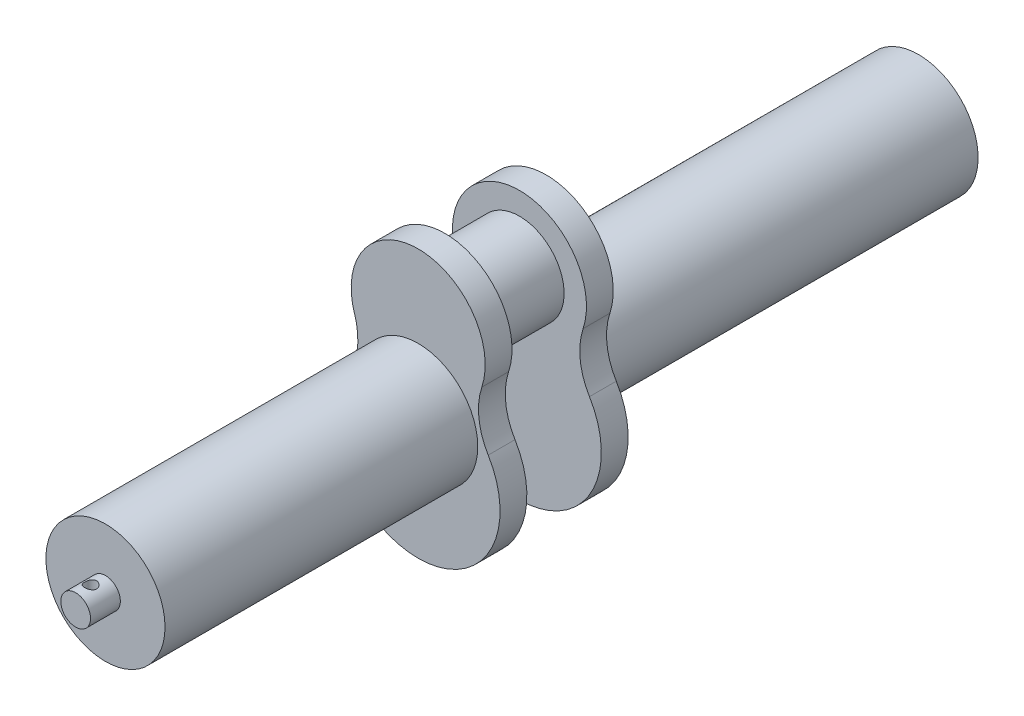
from build123d import *

# Parameters (mm, degrees)
SZKIC1_R                                    = 30
DODANIE_WYCI_GNI_CIE1_DEPTH                 = 25
DODANIE_WYCI_GNI_CIE2_DEPTH                 = 18
SZKIC3_R                                    = 40
DODANIE_WYCI_GNI_CIE3_DEPTH                 = 210
DODANIE_WYCI_GNI_CIE4_START                 = 250
SZKIC4_R                                    = 40
DODANIE_WYCI_GNI_CIE4_DEPTH                 = 250
SZKIC5_R                                    = 10
DODANIE_WYCI_GNI_CIE5_DEPTH                 = 20
WYTNIJ_WYCI_GNI_CIE1_REACH                  = 314.888
WYTNIJ_WYCI_GNI_CIE1_END_RADIUS             = 10
SZKIC6_R                                    = 4
WYTNIJ_WYCI_GNI_CIE1_DIRECTION_2_REACH      = 314.888
WYTNIJ_WYCI_GNI_CIE1_DIRECTION_2_END_RADIUS = 10


with BuildPart() as part:
    # Szkic1 → Dodanie-wyci_gni_cie1 (new, symmetric)
    with BuildSketch(Plane.XY):
        with Locations((0, 50)):
            Circle(SZKIC1_R)
    extrude(amount=DODANIE_WYCI_GNI_CIE1_DEPTH, both=True)

    # Szkic2 → Dodanie-wyci_gni_cie2 (add)
    with BuildSketch(Plane.XY.offset(25)):
        with BuildLine():
            ThreePointArc((42.746299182, 35.9375), (0, 95), (-42.746299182, 35.9375))
            ThreePointArc((-42.746299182, 35.9375), (-40.783578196, 16.765840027), (-47.0209291, -1.46875))
            ThreePointArc((-47.0209291, -1.46875), (0, -85), (47.0209291, -1.46875))
            ThreePointArc((47.0209291, -1.46875), (40.783578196, 16.765840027), (42.746299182, 35.9375))
        make_face()
    dodanie_wyci_gni_cie2 = extrude(amount=DODANIE_WYCI_GNI_CIE2_DEPTH)

    # Szkic3 → Dodanie-wyci_gni_cie3 (add)
    with BuildSketch(Plane.XY.offset(43)):
        Circle(SZKIC3_R)
    extrude(amount=DODANIE_WYCI_GNI_CIE3_DEPTH)

    # Lustro2: Dodanie-wyci_gni_cie2 across plane
    add(dodanie_wyci_gni_cie2.mirror(Plane.XY))

    # Szkic4 → Dodanie-wyci_gni_cie4 (add)
    with BuildSketch(Plane(origin=(0, 0, -43), x_dir=(-1, 0, 0), z_dir=(0, 0, -1)).offset(DODANIE_WYCI_GNI_CIE4_START)):
        with Locations(Location((0, 0, 0), (0, 0, 180))):
            Circle(SZKIC4_R)
    extrude(amount=-DODANIE_WYCI_GNI_CIE4_DEPTH)

    # Szkic5 → Dodanie-wyci_gni_cie5 (add)
    with BuildSketch(Plane.XY.offset(253)):
        Circle(SZKIC5_R)
    extrude(amount=DODANIE_WYCI_GNI_CIE5_DEPTH)

    # Wytnij-wyci_gni_cie1: up to this cylinder (the profile starts inside it)
    wytnij_wyci_gni_cie1_end = Plane(origin=(0, 0, 263), z_dir=(0, 0, -1)) * Cylinder(WYTNIJ_WYCI_GNI_CIE1_END_RADIUS, 650.776, mode=Mode.PRIVATE)
    # Szkic6 → Wytnij-wyci_gni_cie1 (cut, up to the surface)
    with BuildSketch(Plane(origin=(0, 0, 0), x_dir=(1, 0, 0), z_dir=(0, 1, 0)), mode=Mode.PRIVATE) as wytnij_wyci_gni_cie1_sk1:
        with Locations(Location((0, -263, 0), (0, 0, 90))):
            Circle(SZKIC6_R)
    wytnij_wyci_gni_cie1_tool1 = extrude(wytnij_wyci_gni_cie1_sk1.sketch, amount=-WYTNIJ_WYCI_GNI_CIE1_REACH, mode=Mode.PRIVATE) & wytnij_wyci_gni_cie1_end
    add(wytnij_wyci_gni_cie1_tool1.solids().sort_by_distance((0, 0, 263))[0], mode=Mode.SUBTRACT)

    # Wytnij-wyci_gni_cie1 direction 2: up to this cylinder (the profile starts inside it)
    wytnij_wyci_gni_cie1_direction_2_end = Plane(origin=(0, 0, 263), z_dir=(0, 0, -1)) * Cylinder(WYTNIJ_WYCI_GNI_CIE1_DIRECTION_2_END_RADIUS, 650.776, mode=Mode.PRIVATE)
    # Szkic6 → Wytnij-wyci_gni_cie1 direction 2 (cut, up to the surface)
    with BuildSketch(Plane(origin=(0, 0, 0), x_dir=(1, 0, 0), z_dir=(0, 1, 0)), mode=Mode.PRIVATE) as wytnij_wyci_gni_cie1_direction_2_sk1:
        with Locations(Location((0, -263, 0), (0, 0, 90))):
            Circle(SZKIC6_R)
    wytnij_wyci_gni_cie1_direction_2_tool1 = extrude(wytnij_wyci_gni_cie1_direction_2_sk1.sketch, amount=WYTNIJ_WYCI_GNI_CIE1_DIRECTION_2_REACH, mode=Mode.PRIVATE) & wytnij_wyci_gni_cie1_direction_2_end
    add(wytnij_wyci_gni_cie1_direction_2_tool1.solids().sort_by_distance((0, 0, 263))[0], mode=Mode.SUBTRACT)


solid = part.part
